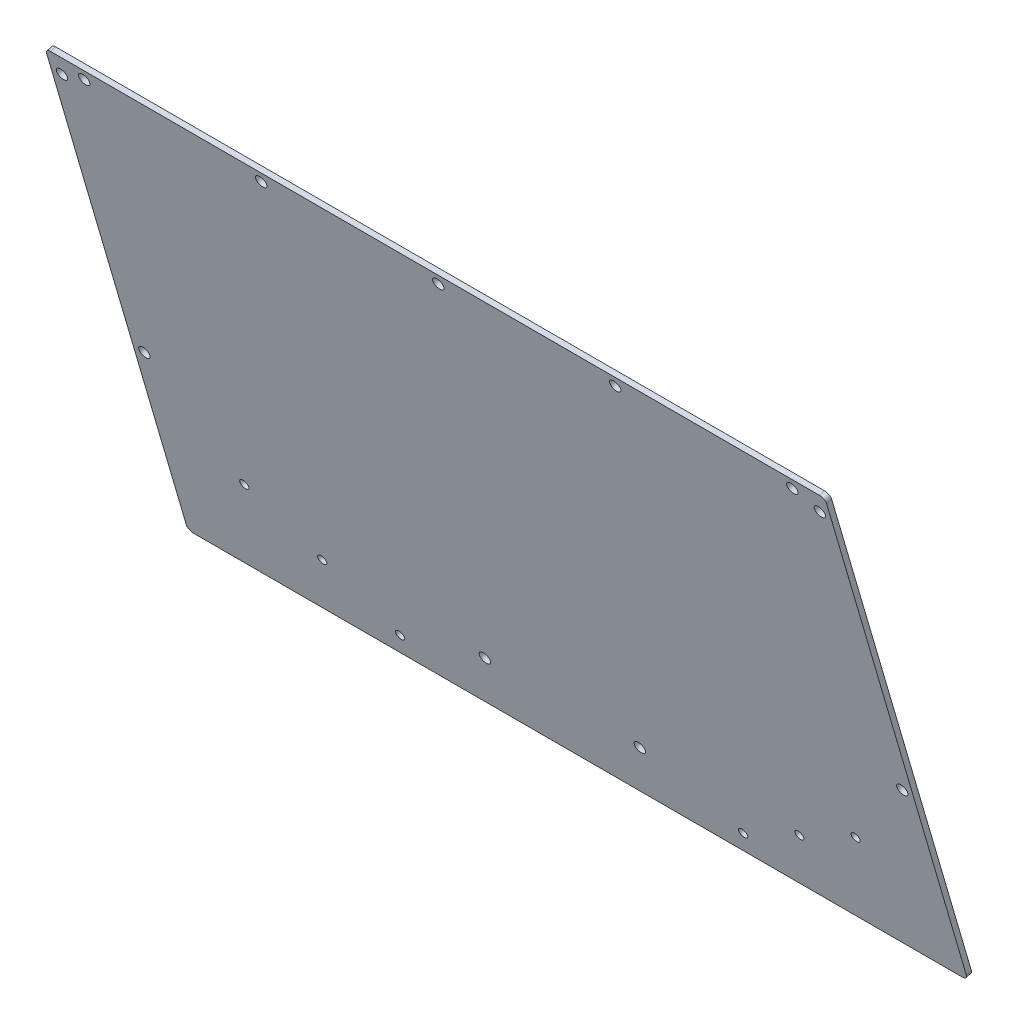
ISO-10303-21;
HEADER;
FILE_DESCRIPTION(('STEP AP214'),'2;1');
FILE_NAME('part.step','',(''),(''),'','','');
FILE_SCHEMA(('AUTOMOTIVE_DESIGN { 1 0 10303 214 1 1 1 1 }'));
ENDSEC;
DATA;
#1=APPLICATION_CONTEXT('core data for automotive mechanical design processes');
#2=APPLICATION_PROTOCOL_DEFINITION('international standard','automotive_design',2000,#1);
#3=PRODUCT_CONTEXT('',#1,'mechanical');
#4=PRODUCT('Part','Part','',(#3));
#5=PRODUCT_RELATED_PRODUCT_CATEGORY('part','',(#4));
#6=PRODUCT_DEFINITION_FORMATION('','',#4);
#7=PRODUCT_DEFINITION_CONTEXT('part definition',#1,'design');
#8=PRODUCT_DEFINITION('design','',#6,#7);
#9=PRODUCT_DEFINITION_SHAPE('','',#8);
#10=(LENGTH_UNIT() NAMED_UNIT(*) SI_UNIT(.MILLI.,.METRE.));
#11=(NAMED_UNIT(*) PLANE_ANGLE_UNIT() SI_UNIT($,.RADIAN.));
#12=(NAMED_UNIT(*) SI_UNIT($,.STERADIAN.) SOLID_ANGLE_UNIT());
#13=UNCERTAINTY_MEASURE_WITH_UNIT(LENGTH_MEASURE(1.E-05),#10,'distance_accuracy_value','');
#14=(GEOMETRIC_REPRESENTATION_CONTEXT(3) GLOBAL_UNCERTAINTY_ASSIGNED_CONTEXT((#13)) GLOBAL_UNIT_ASSIGNED_CONTEXT((#10,
#11,#12)) REPRESENTATION_CONTEXT('',''));
#15=CARTESIAN_POINT('',(0.,0.,0.));
#16=DIRECTION('',(0.,0.,1.));
#17=DIRECTION('',(1.,0.,0.));
#18=AXIS2_PLACEMENT_3D('',#15,#16,#17);
#19=CARTESIAN_POINT('',(203.2,148.986625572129,222.62907670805));
#20=DIRECTION('',(0.,0.280438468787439,-0.959872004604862));
#21=DIRECTION('',(0.,0.959872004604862,0.280438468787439));
#22=AXIS2_PLACEMENT_3D('',#19,#20,#21);
#23=CYLINDRICAL_SURFACE('',#22,3.175);
#24=CARTESIAN_POINT('',(203.2,149.827155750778,219.752148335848));
#25=DIRECTION('',(0.,0.280438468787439,-0.959872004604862));
#26=DIRECTION('',(0.,-0.959872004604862,-0.280438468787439));
#27=AXIS2_PLACEMENT_3D('',#24,#25,#26);
#28=CIRCLE('',#27,3.175);
#29=CARTESIAN_POINT('',(203.2,146.779562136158,218.861756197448));
#30=VERTEX_POINT('',#29);
#31=EDGE_CURVE('E263',#30,#30,#28,.T.);
#32=ORIENTED_EDGE('',*,*,#31,.T.);
#33=EDGE_LOOP('',(#32));
#34=FACE_BOUND('',#33,.T.);
#35=CARTESIAN_POINT('',(203.2,148.986625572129,222.62907670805));
#36=DIRECTION('',(0.,0.280438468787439,-0.959872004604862));
#37=DIRECTION('',(0.,0.959872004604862,0.280438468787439));
#38=AXIS2_PLACEMENT_3D('',#35,#36,#37);
#39=CIRCLE('',#38,3.175);
#40=CARTESIAN_POINT('',(203.2,152.034219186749,223.51946884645));
#41=VERTEX_POINT('',#40);
#42=EDGE_CURVE('E385',#41,#41,#39,.T.);
#43=ORIENTED_EDGE('',*,*,#42,.F.);
#44=EDGE_LOOP('',(#43));
#45=FACE_BOUND('',#44,.T.);
#46=ADVANCED_FACE('F17',(#34,#45),#23,.F.);
#47=CARTESIAN_POINT('',(-101.6,148.986625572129,222.62907670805));
#48=DIRECTION('',(0.,0.280438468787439,-0.959872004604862));
#49=DIRECTION('',(0.,0.959872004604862,0.280438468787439));
#50=AXIS2_PLACEMENT_3D('',#47,#48,#49);
#51=CYLINDRICAL_SURFACE('',#50,3.175);
#52=CARTESIAN_POINT('',(-101.6,149.827155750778,219.752148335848));
#53=DIRECTION('',(0.,0.280438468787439,-0.959872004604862));
#54=DIRECTION('',(0.,-0.959872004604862,-0.280438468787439));
#55=AXIS2_PLACEMENT_3D('',#52,#53,#54);
#56=CIRCLE('',#55,3.175);
#57=CARTESIAN_POINT('',(-101.6,146.779562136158,218.861756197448));
#58=VERTEX_POINT('',#57);
#59=EDGE_CURVE('E266',#58,#58,#56,.T.);
#60=ORIENTED_EDGE('',*,*,#59,.T.);
#61=EDGE_LOOP('',(#60));
#62=FACE_BOUND('',#61,.T.);
#63=CARTESIAN_POINT('',(-101.6,148.986625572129,222.62907670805));
#64=DIRECTION('',(0.,0.280438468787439,-0.959872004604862));
#65=DIRECTION('',(0.,0.959872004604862,0.280438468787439));
#66=AXIS2_PLACEMENT_3D('',#63,#64,#65);
#67=CIRCLE('',#66,3.175);
#68=CARTESIAN_POINT('',(-101.6,152.034219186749,223.51946884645));
#69=VERTEX_POINT('',#68);
#70=EDGE_CURVE('E388',#69,#69,#67,.T.);
#71=ORIENTED_EDGE('',*,*,#70,.F.);
#72=EDGE_LOOP('',(#71));
#73=FACE_BOUND('',#72,.T.);
#74=ADVANCED_FACE('F452',(#62,#73),#51,.F.);
#75=CARTESIAN_POINT('',(-203.2,148.986625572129,222.62907670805));
#76=DIRECTION('',(0.,0.280438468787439,-0.959872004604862));
#77=DIRECTION('',(0.,0.959872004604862,0.280438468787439));
#78=AXIS2_PLACEMENT_3D('',#75,#76,#77);
#79=CYLINDRICAL_SURFACE('',#78,3.175);
#80=CARTESIAN_POINT('',(-203.2,149.827155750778,219.752148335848));
#81=DIRECTION('',(0.,0.280438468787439,-0.959872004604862));
#82=DIRECTION('',(0.,-0.959872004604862,-0.280438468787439));
#83=AXIS2_PLACEMENT_3D('',#80,#81,#82);
#84=CIRCLE('',#83,3.175);
#85=CARTESIAN_POINT('',(-203.2,146.779562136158,218.861756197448));
#86=VERTEX_POINT('',#85);
#87=EDGE_CURVE('E267',#86,#86,#84,.T.);
#88=ORIENTED_EDGE('',*,*,#87,.T.);
#89=EDGE_LOOP('',(#88));
#90=FACE_BOUND('',#89,.T.);
#91=CARTESIAN_POINT('',(-203.2,148.986625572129,222.62907670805));
#92=DIRECTION('',(0.,0.280438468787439,-0.959872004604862));
#93=DIRECTION('',(0.,0.959872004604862,0.280438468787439));
#94=AXIS2_PLACEMENT_3D('',#91,#92,#93);
#95=CIRCLE('',#94,3.175);
#96=CARTESIAN_POINT('',(-203.2,152.034219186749,223.51946884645));
#97=VERTEX_POINT('',#96);
#98=EDGE_CURVE('E391',#97,#97,#95,.T.);
#99=ORIENTED_EDGE('',*,*,#98,.F.);
#100=EDGE_LOOP('',(#99));
#101=FACE_BOUND('',#100,.T.);
#102=ADVANCED_FACE('F458',(#90,#101),#79,.F.);
#103=CARTESIAN_POINT('',(101.6,148.986625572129,222.62907670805));
#104=DIRECTION('',(0.,0.280438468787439,-0.959872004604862));
#105=DIRECTION('',(0.,0.959872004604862,0.280438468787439));
#106=AXIS2_PLACEMENT_3D('',#103,#104,#105);
#107=CYLINDRICAL_SURFACE('',#106,3.175);
#108=CARTESIAN_POINT('',(101.6,149.827155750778,219.752148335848));
#109=DIRECTION('',(0.,0.280438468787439,-0.959872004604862));
#110=DIRECTION('',(0.,-0.959872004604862,-0.280438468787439));
#111=AXIS2_PLACEMENT_3D('',#108,#109,#110);
#112=CIRCLE('',#111,3.175);
#113=CARTESIAN_POINT('',(101.6,146.779562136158,218.861756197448));
#114=VERTEX_POINT('',#113);
#115=EDGE_CURVE('E270',#114,#114,#112,.T.);
#116=ORIENTED_EDGE('',*,*,#115,.T.);
#117=EDGE_LOOP('',(#116));
#118=FACE_BOUND('',#117,.T.);
#119=CARTESIAN_POINT('',(101.6,148.986625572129,222.62907670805));
#120=DIRECTION('',(0.,0.280438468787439,-0.959872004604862));
#121=DIRECTION('',(0.,0.959872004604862,0.280438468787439));
#122=AXIS2_PLACEMENT_3D('',#119,#120,#121);
#123=CIRCLE('',#122,3.175);
#124=CARTESIAN_POINT('',(101.6,152.034219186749,223.51946884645));
#125=VERTEX_POINT('',#124);
#126=EDGE_CURVE('E396',#125,#125,#123,.T.);
#127=ORIENTED_EDGE('',*,*,#126,.F.);
#128=EDGE_LOOP('',(#127));
#129=FACE_BOUND('',#128,.T.);
#130=ADVANCED_FACE('F537',(#118,#129),#107,.F.);
#131=CARTESIAN_POINT('',(0.,148.986625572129,222.62907670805));
#132=DIRECTION('',(0.,0.280438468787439,-0.959872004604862));
#133=DIRECTION('',(0.,0.959872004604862,0.280438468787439));
#134=AXIS2_PLACEMENT_3D('',#131,#132,#133);
#135=CYLINDRICAL_SURFACE('',#134,3.175);
#136=CARTESIAN_POINT('',(0.,149.827155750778,219.752148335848));
#137=DIRECTION('',(0.,0.280438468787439,-0.959872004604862));
#138=DIRECTION('',(0.,-0.959872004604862,-0.280438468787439));
#139=AXIS2_PLACEMENT_3D('',#136,#137,#138);
#140=CIRCLE('',#139,3.175);
#141=CARTESIAN_POINT('',(0.,146.779562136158,218.861756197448));
#142=VERTEX_POINT('',#141);
#143=EDGE_CURVE('E273',#142,#142,#140,.T.);
#144=ORIENTED_EDGE('',*,*,#143,.T.);
#145=EDGE_LOOP('',(#144));
#146=FACE_BOUND('',#145,.T.);
#147=CARTESIAN_POINT('',(0.,148.986625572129,222.62907670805));
#148=DIRECTION('',(0.,0.280438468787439,-0.959872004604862));
#149=DIRECTION('',(0.,0.959872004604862,0.280438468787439));
#150=AXIS2_PLACEMENT_3D('',#147,#148,#149);
#151=CIRCLE('',#150,3.175);
#152=CARTESIAN_POINT('',(0.,152.034219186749,223.51946884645));
#153=VERTEX_POINT('',#152);
#154=EDGE_CURVE('E399',#153,#153,#151,.T.);
#155=ORIENTED_EDGE('',*,*,#154,.F.);
#156=EDGE_LOOP('',(#155));
#157=FACE_BOUND('',#156,.T.);
#158=ADVANCED_FACE('F544',(#146,#157),#135,.F.);
#159=CARTESIAN_POINT('',(-44.45,-94.8208635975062,151.39770563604));
#160=DIRECTION('',(0.,0.280438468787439,-0.959872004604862));
#161=DIRECTION('',(0.,0.959872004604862,0.280438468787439));
#162=AXIS2_PLACEMENT_3D('',#159,#160,#161);
#163=CYLINDRICAL_SURFACE('',#162,3.175);
#164=CARTESIAN_POINT('',(-44.45,-93.9803334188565,148.520777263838));
#165=DIRECTION('',(0.,0.280438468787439,-0.959872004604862));
#166=DIRECTION('',(0.,-0.959872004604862,-0.280438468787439));
#167=AXIS2_PLACEMENT_3D('',#164,#165,#166);
#168=CIRCLE('',#167,3.175);
#169=CARTESIAN_POINT('',(-44.45,-97.0279270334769,147.630385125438));
#170=VERTEX_POINT('',#169);
#171=EDGE_CURVE('E276',#170,#170,#168,.T.);
#172=ORIENTED_EDGE('',*,*,#171,.T.);
#173=EDGE_LOOP('',(#172));
#174=FACE_BOUND('',#173,.T.);
#175=CARTESIAN_POINT('',(-44.45,-94.8208635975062,151.39770563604));
#176=DIRECTION('',(0.,0.280438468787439,-0.959872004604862));
#177=DIRECTION('',(0.,0.959872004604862,0.280438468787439));
#178=AXIS2_PLACEMENT_3D('',#175,#176,#177);
#179=CIRCLE('',#178,3.175);
#180=CARTESIAN_POINT('',(-44.45,-91.7732699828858,152.288097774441));
#181=VERTEX_POINT('',#180);
#182=EDGE_CURVE('E404',#181,#181,#179,.T.);
#183=ORIENTED_EDGE('',*,*,#182,.F.);
#184=EDGE_LOOP('',(#183));
#185=FACE_BOUND('',#184,.T.);
#186=ADVANCED_FACE('F550',(#174,#185),#163,.F.);
#187=CARTESIAN_POINT('',(44.45,-94.8208635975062,151.39770563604));
#188=DIRECTION('',(0.,0.280438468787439,-0.959872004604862));
#189=DIRECTION('',(0.,0.959872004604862,0.280438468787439));
#190=AXIS2_PLACEMENT_3D('',#187,#188,#189);
#191=CYLINDRICAL_SURFACE('',#190,3.175);
#192=CARTESIAN_POINT('',(44.45,-93.9803334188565,148.520777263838));
#193=DIRECTION('',(0.,0.280438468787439,-0.959872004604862));
#194=DIRECTION('',(0.,-0.959872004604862,-0.280438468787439));
#195=AXIS2_PLACEMENT_3D('',#192,#193,#194);
#196=CIRCLE('',#195,3.175);
#197=CARTESIAN_POINT('',(44.45,-97.0279270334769,147.630385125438));
#198=VERTEX_POINT('',#197);
#199=EDGE_CURVE('E277',#198,#198,#196,.T.);
#200=ORIENTED_EDGE('',*,*,#199,.T.);
#201=EDGE_LOOP('',(#200));
#202=FACE_BOUND('',#201,.T.);
#203=CARTESIAN_POINT('',(44.45,-94.8208635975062,151.39770563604));
#204=DIRECTION('',(0.,0.280438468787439,-0.959872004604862));
#205=DIRECTION('',(0.,0.959872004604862,0.280438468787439));
#206=AXIS2_PLACEMENT_3D('',#203,#204,#205);
#207=CIRCLE('',#206,3.175);
#208=CARTESIAN_POINT('',(44.45,-91.7732699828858,152.288097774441));
#209=VERTEX_POINT('',#208);
#210=EDGE_CURVE('E406',#209,#209,#207,.T.);
#211=ORIENTED_EDGE('',*,*,#210,.F.);
#212=EDGE_LOOP('',(#211));
#213=FACE_BOUND('',#212,.T.);
#214=ADVANCED_FACE('F553',(#202,#213),#191,.F.);
#215=CARTESIAN_POINT('',(-175.414658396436,-70.4401146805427,158.520842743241));
#216=DIRECTION('',(0.,0.280438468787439,-0.959872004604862));
#217=DIRECTION('',(0.,0.959872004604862,0.280438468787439));
#218=AXIS2_PLACEMENT_3D('',#215,#216,#217);
#219=CYLINDRICAL_SURFACE('',#218,2.5527);
#220=CARTESIAN_POINT('',(-175.414658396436,-69.599584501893,155.643914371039));
#221=DIRECTION('',(0.,0.280438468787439,-0.959872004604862));
#222=DIRECTION('',(0.,-0.959872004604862,-0.280438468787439));
#223=AXIS2_PLACEMENT_3D('',#220,#221,#222);
#224=CIRCLE('',#223,2.5527);
#225=CARTESIAN_POINT('',(-175.414658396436,-72.0498497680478,154.928039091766));
#226=VERTEX_POINT('',#225);
#227=EDGE_CURVE('E280',#226,#226,#224,.T.);
#228=ORIENTED_EDGE('',*,*,#227,.T.);
#229=EDGE_LOOP('',(#228));
#230=FACE_BOUND('',#229,.T.);
#231=CARTESIAN_POINT('',(-175.414658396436,-70.4401146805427,158.520842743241));
#232=DIRECTION('',(0.,0.280438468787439,-0.959872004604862));
#233=DIRECTION('',(0.,0.959872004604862,0.280438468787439));
#234=AXIS2_PLACEMENT_3D('',#231,#232,#233);
#235=CIRCLE('',#234,2.5527);
#236=CARTESIAN_POINT('',(-175.414658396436,-67.9898494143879,159.236718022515));
#237=VERTEX_POINT('',#236);
#238=EDGE_CURVE('E410',#237,#237,#235,.T.);
#239=ORIENTED_EDGE('',*,*,#238,.F.);
#240=EDGE_LOOP('',(#239));
#241=FACE_BOUND('',#240,.T.);
#242=ADVANCED_FACE('F558',(#230,#241),#219,.F.);
#243=CARTESIAN_POINT('',(-136.919829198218,-91.7732699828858,152.288097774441));
#244=DIRECTION('',(0.,0.280438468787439,-0.959872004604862));
#245=DIRECTION('',(0.,0.959872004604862,0.280438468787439));
#246=AXIS2_PLACEMENT_3D('',#243,#244,#245);
#247=CYLINDRICAL_SURFACE('',#246,2.5527);
#248=CARTESIAN_POINT('',(-136.919829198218,-90.9327398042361,149.411169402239));
#249=DIRECTION('',(0.,0.280438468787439,-0.959872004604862));
#250=DIRECTION('',(0.,-0.959872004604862,-0.280438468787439));
#251=AXIS2_PLACEMENT_3D('',#248,#249,#250);
#252=CIRCLE('',#251,2.5527);
#253=CARTESIAN_POINT('',(-136.919829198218,-93.3830050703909,148.695294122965));
#254=VERTEX_POINT('',#253);
#255=EDGE_CURVE('E281',#254,#254,#252,.T.);
#256=ORIENTED_EDGE('',*,*,#255,.T.);
#257=EDGE_LOOP('',(#256));
#258=FACE_BOUND('',#257,.T.);
#259=CARTESIAN_POINT('',(-136.919829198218,-91.7732699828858,152.288097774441));
#260=DIRECTION('',(0.,0.280438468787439,-0.959872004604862));
#261=DIRECTION('',(0.,0.959872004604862,0.280438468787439));
#262=AXIS2_PLACEMENT_3D('',#259,#260,#261);
#263=CIRCLE('',#262,2.5527);
#264=CARTESIAN_POINT('',(-136.919829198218,-89.323004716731,153.003973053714));
#265=VERTEX_POINT('',#264);
#266=EDGE_CURVE('E413',#265,#265,#263,.T.);
#267=ORIENTED_EDGE('',*,*,#266,.F.);
#268=EDGE_LOOP('',(#267));
#269=FACE_BOUND('',#268,.T.);
#270=ADVANCED_FACE('F562',(#258,#269),#247,.F.);
#271=CARTESIAN_POINT('',(-98.425,-113.106425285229,146.055352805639));
#272=DIRECTION('',(0.,0.280438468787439,-0.959872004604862));
#273=DIRECTION('',(0.,0.959872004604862,0.280438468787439));
#274=AXIS2_PLACEMENT_3D('',#271,#272,#273);
#275=CYLINDRICAL_SURFACE('',#274,2.5527);
#276=CARTESIAN_POINT('',(-98.425,-112.265895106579,143.178424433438));
#277=DIRECTION('',(0.,0.280438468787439,-0.959872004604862));
#278=DIRECTION('',(0.,-0.959872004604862,-0.280438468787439));
#279=AXIS2_PLACEMENT_3D('',#276,#277,#278);
#280=CIRCLE('',#279,2.5527);
#281=CARTESIAN_POINT('',(-98.425,-114.716160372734,142.462549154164));
#282=VERTEX_POINT('',#281);
#283=EDGE_CURVE('E284',#282,#282,#280,.T.);
#284=ORIENTED_EDGE('',*,*,#283,.T.);
#285=EDGE_LOOP('',(#284));
#286=FACE_BOUND('',#285,.T.);
#287=CARTESIAN_POINT('',(-98.425,-113.106425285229,146.055352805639));
#288=DIRECTION('',(0.,0.280438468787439,-0.959872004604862));
#289=DIRECTION('',(0.,0.959872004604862,0.280438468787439));
#290=AXIS2_PLACEMENT_3D('',#287,#288,#289);
#291=CIRCLE('',#290,2.5527);
#292=CARTESIAN_POINT('',(-98.425,-110.656160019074,146.771228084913));
#293=VERTEX_POINT('',#292);
#294=EDGE_CURVE('E416',#293,#293,#291,.T.);
#295=ORIENTED_EDGE('',*,*,#294,.F.);
#296=EDGE_LOOP('',(#295));
#297=FACE_BOUND('',#296,.T.);
#298=ADVANCED_FACE('F497',(#286,#297),#275,.F.);
#299=CARTESIAN_POINT('',(175.414658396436,-70.4401146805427,158.520842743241));
#300=DIRECTION('',(0.,0.280438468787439,-0.959872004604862));
#301=DIRECTION('',(0.,0.959872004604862,0.280438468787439));
#302=AXIS2_PLACEMENT_3D('',#299,#300,#301);
#303=CYLINDRICAL_SURFACE('',#302,2.5527);
#304=CARTESIAN_POINT('',(175.414658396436,-69.599584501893,155.643914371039));
#305=DIRECTION('',(0.,0.280438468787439,-0.959872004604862));
#306=DIRECTION('',(0.,-0.959872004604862,-0.280438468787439));
#307=AXIS2_PLACEMENT_3D('',#304,#305,#306);
#308=CIRCLE('',#307,2.5527);
#309=CARTESIAN_POINT('',(175.414658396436,-72.0498497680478,154.928039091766));
#310=VERTEX_POINT('',#309);
#311=EDGE_CURVE('E289',#310,#310,#308,.T.);
#312=ORIENTED_EDGE('',*,*,#311,.T.);
#313=EDGE_LOOP('',(#312));
#314=FACE_BOUND('',#313,.T.);
#315=CARTESIAN_POINT('',(175.414658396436,-70.4401146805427,158.520842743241));
#316=DIRECTION('',(0.,0.280438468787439,-0.959872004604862));
#317=DIRECTION('',(0.,0.959872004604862,0.280438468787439));
#318=AXIS2_PLACEMENT_3D('',#315,#316,#317);
#319=CIRCLE('',#318,2.5527);
#320=CARTESIAN_POINT('',(175.414658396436,-67.9898494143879,159.236718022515));
#321=VERTEX_POINT('',#320);
#322=EDGE_CURVE('E419',#321,#321,#319,.T.);
#323=ORIENTED_EDGE('',*,*,#322,.F.);
#324=EDGE_LOOP('',(#323));
#325=FACE_BOUND('',#324,.T.);
#326=ADVANCED_FACE('F494',(#314,#325),#303,.F.);
#327=CARTESIAN_POINT('',(136.919829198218,-91.7732699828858,152.288097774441));
#328=DIRECTION('',(0.,0.280438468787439,-0.959872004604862));
#329=DIRECTION('',(0.,0.959872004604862,0.280438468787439));
#330=AXIS2_PLACEMENT_3D('',#327,#328,#329);
#331=CYLINDRICAL_SURFACE('',#330,2.5527);
#332=CARTESIAN_POINT('',(136.919829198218,-90.9327398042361,149.411169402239));
#333=DIRECTION('',(0.,0.280438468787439,-0.959872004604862));
#334=DIRECTION('',(0.,-0.959872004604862,-0.280438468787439));
#335=AXIS2_PLACEMENT_3D('',#332,#333,#334);
#336=CIRCLE('',#335,2.5527);
#337=CARTESIAN_POINT('',(136.919829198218,-93.3830050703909,148.695294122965));
#338=VERTEX_POINT('',#337);
#339=EDGE_CURVE('E285',#338,#338,#336,.T.);
#340=ORIENTED_EDGE('',*,*,#339,.T.);
#341=EDGE_LOOP('',(#340));
#342=FACE_BOUND('',#341,.T.);
#343=CARTESIAN_POINT('',(136.919829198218,-91.7732699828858,152.288097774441));
#344=DIRECTION('',(0.,0.280438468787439,-0.959872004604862));
#345=DIRECTION('',(0.,0.959872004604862,0.280438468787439));
#346=AXIS2_PLACEMENT_3D('',#343,#344,#345);
#347=CIRCLE('',#346,2.5527);
#348=CARTESIAN_POINT('',(136.919829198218,-89.323004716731,153.003973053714));
#349=VERTEX_POINT('',#348);
#350=EDGE_CURVE('E423',#349,#349,#347,.T.);
#351=ORIENTED_EDGE('',*,*,#350,.F.);
#352=EDGE_LOOP('',(#351));
#353=FACE_BOUND('',#352,.T.);
#354=ADVANCED_FACE('F496',(#342,#353),#331,.F.);
#355=CARTESIAN_POINT('',(98.425,-113.106425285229,146.055352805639));
#356=DIRECTION('',(0.,0.280438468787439,-0.959872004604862));
#357=DIRECTION('',(0.,0.959872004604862,0.280438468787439));
#358=AXIS2_PLACEMENT_3D('',#355,#356,#357);
#359=CYLINDRICAL_SURFACE('',#358,2.5527);
#360=CARTESIAN_POINT('',(98.425,-112.265895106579,143.178424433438));
#361=DIRECTION('',(0.,0.280438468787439,-0.959872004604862));
#362=DIRECTION('',(0.,-0.959872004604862,-0.280438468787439));
#363=AXIS2_PLACEMENT_3D('',#360,#361,#362);
#364=CIRCLE('',#363,2.5527);
#365=CARTESIAN_POINT('',(98.425,-114.716160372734,142.462549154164));
#366=VERTEX_POINT('',#365);
#367=EDGE_CURVE('E288',#366,#366,#364,.T.);
#368=ORIENTED_EDGE('',*,*,#367,.T.);
#369=EDGE_LOOP('',(#368));
#370=FACE_BOUND('',#369,.T.);
#371=CARTESIAN_POINT('',(98.425,-113.106425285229,146.05535280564));
#372=DIRECTION('',(0.,0.280438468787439,-0.959872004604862));
#373=DIRECTION('',(0.,0.959872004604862,0.280438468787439));
#374=AXIS2_PLACEMENT_3D('',#371,#372,#373);
#375=CIRCLE('',#374,2.5527);
#376=CARTESIAN_POINT('',(98.425,-110.656160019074,146.771228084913));
#377=VERTEX_POINT('',#376);
#378=EDGE_CURVE('E420',#377,#377,#375,.T.);
#379=ORIENTED_EDGE('',*,*,#378,.F.);
#380=EDGE_LOOP('',(#379));
#381=FACE_BOUND('',#380,.T.);
#382=ADVANCED_FACE('F501',(#370,#381),#359,.F.);
#383=CARTESIAN_POINT('',(220.6625,152.03421918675,223.51946884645));
#384=DIRECTION('',(0.,-0.280438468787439,0.959872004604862));
#385=DIRECTION('',(0.,-0.959872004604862,-0.280438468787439));
#386=AXIS2_PLACEMENT_3D('',#383,#384,#385);
#387=CYLINDRICAL_SURFACE('',#386,3.175);
#388=CARTESIAN_POINT('',(220.6625,152.03421918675,223.51946884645));
#389=DIRECTION('',(0.,-0.280438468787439,0.959872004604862));
#390=DIRECTION('',(0.,-0.959872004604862,-0.280438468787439));
#391=AXIS2_PLACEMENT_3D('',#388,#389,#390);
#392=CIRCLE('',#391,3.175);
#393=CARTESIAN_POINT('',(223.8375,152.03421918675,223.51946884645));
#394=VERTEX_POINT('',#393);
#395=CARTESIAN_POINT('',(220.6625,155.081812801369,224.40986098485));
#396=VERTEX_POINT('',#395);
#397=EDGE_CURVE('E257',#394,#396,#392,.T.);
#398=ORIENTED_EDGE('',*,*,#397,.F.);
#399=DIRECTION('',(0.,-0.280438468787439,0.959872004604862));
#400=VECTOR('',#399,1.);
#401=CARTESIAN_POINT('',(223.8375,152.03421918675,223.51946884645));
#402=LINE('',#401,#400);
#403=CARTESIAN_POINT('',(223.8375,152.874749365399,220.642540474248));
#404=VERTEX_POINT('',#403);
#405=EDGE_CURVE('E326',#404,#394,#402,.T.);
#406=ORIENTED_EDGE('',*,*,#405,.F.);
#407=CARTESIAN_POINT('',(220.6625,152.874749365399,220.642540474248));
#408=DIRECTION('',(0.,0.280438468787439,-0.959872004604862));
#409=DIRECTION('',(0.,-0.959872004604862,-0.280438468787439));
#410=AXIS2_PLACEMENT_3D('',#407,#408,#409);
#411=CIRCLE('',#410,3.175);
#412=CARTESIAN_POINT('',(220.6625,155.92234298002,221.532932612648));
#413=VERTEX_POINT('',#412);
#414=EDGE_CURVE('E20',#413,#404,#411,.T.);
#415=ORIENTED_EDGE('',*,*,#414,.F.);
#416=DIRECTION('',(0.,0.280438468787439,-0.959872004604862));
#417=VECTOR('',#416,1.);
#418=CARTESIAN_POINT('',(220.6625,155.92234298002,221.532932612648));
#419=LINE('',#418,#417);
#420=EDGE_CURVE('E363',#396,#413,#419,.T.);
#421=ORIENTED_EDGE('',*,*,#420,.F.);
#422=EDGE_LOOP('',(#398,#406,#415,#421));
#423=FACE_BOUND('',#422,.T.);
#424=ADVANCED_FACE('F507',(#423),#387,.T.);
#425=CARTESIAN_POINT('',(-220.6625,152.03421918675,223.51946884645));
#426=DIRECTION('',(0.,0.280438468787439,-0.959872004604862));
#427=DIRECTION('',(0.,0.959872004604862,0.280438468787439));
#428=AXIS2_PLACEMENT_3D('',#425,#426,#427);
#429=CYLINDRICAL_SURFACE('',#428,3.175);
#430=CARTESIAN_POINT('',(-220.6625,152.034219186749,223.51946884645));
#431=DIRECTION('',(0.,-0.280438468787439,0.959872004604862));
#432=DIRECTION('',(0.,-0.959872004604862,-0.280438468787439));
#433=AXIS2_PLACEMENT_3D('',#430,#431,#432);
#434=CIRCLE('',#433,3.175);
#435=CARTESIAN_POINT('',(-220.6625,155.081812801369,224.40986098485));
#436=VERTEX_POINT('',#435);
#437=CARTESIAN_POINT('',(-223.8375,152.03421918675,223.51946884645));
#438=VERTEX_POINT('',#437);
#439=EDGE_CURVE('E260',#436,#438,#434,.T.);
#440=ORIENTED_EDGE('',*,*,#439,.F.);
#441=DIRECTION('',(0.,-0.280438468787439,0.959872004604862));
#442=VECTOR('',#441,1.);
#443=CARTESIAN_POINT('',(-220.6625,155.081812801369,224.40986098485));
#444=LINE('',#443,#442);
#445=CARTESIAN_POINT('',(-220.6625,155.92234298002,221.532932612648));
#446=VERTEX_POINT('',#445);
#447=EDGE_CURVE('E325',#446,#436,#444,.T.);
#448=ORIENTED_EDGE('',*,*,#447,.F.);
#449=CARTESIAN_POINT('',(-220.6625,152.874749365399,220.642540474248));
#450=DIRECTION('',(0.,0.280438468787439,-0.959872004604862));
#451=DIRECTION('',(0.,-0.959872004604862,-0.280438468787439));
#452=AXIS2_PLACEMENT_3D('',#449,#450,#451);
#453=CIRCLE('',#452,3.175);
#454=CARTESIAN_POINT('',(-223.8375,152.874749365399,220.642540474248));
#455=VERTEX_POINT('',#454);
#456=EDGE_CURVE('E299',#455,#446,#453,.T.);
#457=ORIENTED_EDGE('',*,*,#456,.F.);
#458=DIRECTION('',(0.,0.280438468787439,-0.959872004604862));
#459=VECTOR('',#458,1.);
#460=CARTESIAN_POINT('',(-223.8375,152.03421918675,223.51946884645));
#461=LINE('',#460,#459);
#462=EDGE_CURVE('E360',#438,#455,#461,.T.);
#463=ORIENTED_EDGE('',*,*,#462,.F.);
#464=EDGE_LOOP('',(#440,#448,#457,#463));
#465=FACE_BOUND('',#464,.T.);
#466=ADVANCED_FACE('F572',(#465),#429,.T.);
#467=CARTESIAN_POINT('',(220.6625,-122.24920612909,143.384176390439));
#468=DIRECTION('',(0.,0.280438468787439,-0.959872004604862));
#469=DIRECTION('',(0.,0.959872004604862,0.280438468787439));
#470=AXIS2_PLACEMENT_3D('',#467,#468,#469);
#471=CYLINDRICAL_SURFACE('',#470,3.175);
#472=CARTESIAN_POINT('',(220.6625,-122.24920612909,143.384176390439));
#473=DIRECTION('',(0.,-0.280438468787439,0.959872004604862));
#474=DIRECTION('',(0.,-0.959872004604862,-0.280438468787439));
#475=AXIS2_PLACEMENT_3D('',#472,#473,#474);
#476=CIRCLE('',#475,3.175);
#477=CARTESIAN_POINT('',(220.6625,-125.296799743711,142.493784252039));
#478=VERTEX_POINT('',#477);
#479=CARTESIAN_POINT('',(223.8375,-122.24920612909,143.384176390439));
#480=VERTEX_POINT('',#479);
#481=EDGE_CURVE('E256',#478,#480,#476,.T.);
#482=ORIENTED_EDGE('',*,*,#481,.F.);
#483=DIRECTION('',(0.,-0.280438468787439,0.959872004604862));
#484=VECTOR('',#483,1.);
#485=CARTESIAN_POINT('',(220.6625,-125.296799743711,142.493784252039));
#486=LINE('',#485,#484);
#487=CARTESIAN_POINT('',(220.6625,-124.456269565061,139.616855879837));
#488=VERTEX_POINT('',#487);
#489=EDGE_CURVE('E334',#488,#478,#486,.T.);
#490=ORIENTED_EDGE('',*,*,#489,.F.);
#491=CARTESIAN_POINT('',(220.6625,-121.40867595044,140.507248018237));
#492=DIRECTION('',(0.,0.280438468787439,-0.959872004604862));
#493=DIRECTION('',(0.,-0.959872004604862,-0.280438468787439));
#494=AXIS2_PLACEMENT_3D('',#491,#492,#493);
#495=CIRCLE('',#494,3.175);
#496=CARTESIAN_POINT('',(223.8375,-121.40867595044,140.507248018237));
#497=VERTEX_POINT('',#496);
#498=EDGE_CURVE('E11',#497,#488,#495,.T.);
#499=ORIENTED_EDGE('',*,*,#498,.F.);
#500=DIRECTION('',(0.,0.280438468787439,-0.959872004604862));
#501=VECTOR('',#500,1.);
#502=CARTESIAN_POINT('',(223.8375,-122.24920612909,143.384176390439));
#503=LINE('',#502,#501);
#504=EDGE_CURVE('E350',#480,#497,#503,.T.);
#505=ORIENTED_EDGE('',*,*,#504,.F.);
#506=EDGE_LOOP('',(#482,#490,#499,#505));
#507=FACE_BOUND('',#506,.T.);
#508=ADVANCED_FACE('F448',(#507),#471,.T.);
#509=CARTESIAN_POINT('',(-220.6625,-122.24920612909,143.384176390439));
#510=DIRECTION('',(0.,-0.280438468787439,0.959872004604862));
#511=DIRECTION('',(0.,-0.959872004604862,-0.280438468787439));
#512=AXIS2_PLACEMENT_3D('',#509,#510,#511);
#513=CYLINDRICAL_SURFACE('',#512,3.175);
#514=CARTESIAN_POINT('',(-220.6625,-122.24920612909,143.384176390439));
#515=DIRECTION('',(0.,-0.280438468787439,0.959872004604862));
#516=DIRECTION('',(0.,-0.959872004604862,-0.280438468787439));
#517=AXIS2_PLACEMENT_3D('',#514,#515,#516);
#518=CIRCLE('',#517,3.175);
#519=CARTESIAN_POINT('',(-223.8375,-122.24920612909,143.384176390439));
#520=VERTEX_POINT('',#519);
#521=CARTESIAN_POINT('',(-220.6625,-125.296799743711,142.493784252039));
#522=VERTEX_POINT('',#521);
#523=EDGE_CURVE('E248',#520,#522,#518,.T.);
#524=ORIENTED_EDGE('',*,*,#523,.F.);
#525=DIRECTION('',(0.,-0.280438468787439,0.959872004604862));
#526=VECTOR('',#525,1.);
#527=CARTESIAN_POINT('',(-223.8375,-122.24920612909,143.384176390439));
#528=LINE('',#527,#526);
#529=CARTESIAN_POINT('',(-223.8375,-121.40867595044,140.507248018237));
#530=VERTEX_POINT('',#529);
#531=EDGE_CURVE('E335',#530,#520,#528,.T.);
#532=ORIENTED_EDGE('',*,*,#531,.F.);
#533=CARTESIAN_POINT('',(-220.6625,-121.40867595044,140.507248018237));
#534=DIRECTION('',(0.,0.280438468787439,-0.959872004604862));
#535=DIRECTION('',(0.,-0.959872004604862,-0.280438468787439));
#536=AXIS2_PLACEMENT_3D('',#533,#534,#535);
#537=CIRCLE('',#536,3.175);
#538=CARTESIAN_POINT('',(-220.6625,-124.456269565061,139.616855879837));
#539=VERTEX_POINT('',#538);
#540=EDGE_CURVE('E297',#539,#530,#537,.T.);
#541=ORIENTED_EDGE('',*,*,#540,.F.);
#542=DIRECTION('',(0.,0.280438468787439,-0.959872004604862));
#543=VECTOR('',#542,1.);
#544=CARTESIAN_POINT('',(-220.6625,-124.456269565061,139.616855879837));
#545=LINE('',#544,#543);
#546=EDGE_CURVE('E320',#522,#539,#545,.T.);
#547=ORIENTED_EDGE('',*,*,#546,.F.);
#548=EDGE_LOOP('',(#524,#532,#541,#547));
#549=FACE_BOUND('',#548,.T.);
#550=ADVANCED_FACE('F436',(#549),#513,.T.);
#551=CARTESIAN_POINT('',(-217.4875,143.696822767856,221.083595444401));
#552=DIRECTION('',(0.,0.280438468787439,-0.959872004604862));
#553=DIRECTION('',(0.,0.959872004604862,0.280438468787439));
#554=AXIS2_PLACEMENT_3D('',#551,#552,#553);
#555=CYLINDRICAL_SURFACE('',#554,3.175);
#556=CARTESIAN_POINT('',(-217.4875,144.537352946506,218.206667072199));
#557=DIRECTION('',(0.,0.280438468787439,-0.959872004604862));
#558=DIRECTION('',(0.,-0.959872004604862,-0.280438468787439));
#559=AXIS2_PLACEMENT_3D('',#556,#557,#558);
#560=CIRCLE('',#559,3.175);
#561=CARTESIAN_POINT('',(-217.4875,141.489759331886,217.316274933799));
#562=VERTEX_POINT('',#561);
#563=EDGE_CURVE('E292',#562,#562,#560,.T.);
#564=ORIENTED_EDGE('',*,*,#563,.T.);
#565=EDGE_LOOP('',(#564));
#566=FACE_BOUND('',#565,.T.);
#567=CARTESIAN_POINT('',(-217.4875,143.696822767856,221.083595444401));
#568=DIRECTION('',(0.,0.280438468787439,-0.959872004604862));
#569=DIRECTION('',(0.,0.959872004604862,0.280438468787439));
#570=AXIS2_PLACEMENT_3D('',#567,#568,#569);
#571=CIRCLE('',#570,3.175);
#572=CARTESIAN_POINT('',(-217.4875,146.744416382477,221.973987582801));
#573=VERTEX_POINT('',#572);
#574=EDGE_CURVE('E250',#573,#573,#571,.T.);
#575=ORIENTED_EDGE('',*,*,#574,.F.);
#576=EDGE_LOOP('',(#575));
#577=FACE_BOUND('',#576,.T.);
#578=ADVANCED_FACE('F433',(#566,#577),#555,.F.);
#579=CARTESIAN_POINT('',(-217.4875,-18.228177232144,173.775205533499));
#580=DIRECTION('',(0.,0.280438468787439,-0.959872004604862));
#581=DIRECTION('',(0.,0.959872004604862,0.280438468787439));
#582=AXIS2_PLACEMENT_3D('',#579,#580,#581);
#583=CYLINDRICAL_SURFACE('',#582,3.175);
#584=CARTESIAN_POINT('',(-217.4875,-17.3876470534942,170.898277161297));
#585=DIRECTION('',(0.,0.280438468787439,-0.959872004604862));
#586=DIRECTION('',(0.,-0.959872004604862,-0.280438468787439));
#587=AXIS2_PLACEMENT_3D('',#584,#585,#586);
#588=CIRCLE('',#587,3.175);
#589=CARTESIAN_POINT('',(-217.4875,-20.4352406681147,170.007885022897));
#590=VERTEX_POINT('',#589);
#591=EDGE_CURVE('E295',#590,#590,#588,.T.);
#592=ORIENTED_EDGE('',*,*,#591,.T.);
#593=EDGE_LOOP('',(#592));
#594=FACE_BOUND('',#593,.T.);
#595=CARTESIAN_POINT('',(-217.4875,-18.228177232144,173.775205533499));
#596=DIRECTION('',(0.,0.280438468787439,-0.959872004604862));
#597=DIRECTION('',(0.,0.959872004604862,0.280438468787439));
#598=AXIS2_PLACEMENT_3D('',#595,#596,#597);
#599=CIRCLE('',#598,3.175);
#600=CARTESIAN_POINT('',(-217.4875,-15.1805836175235,174.665597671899));
#601=VERTEX_POINT('',#600);
#602=EDGE_CURVE('E243',#601,#601,#599,.T.);
#603=ORIENTED_EDGE('',*,*,#602,.F.);
#604=EDGE_LOOP('',(#603));
#605=FACE_BOUND('',#604,.T.);
#606=ADVANCED_FACE('F435',(#594,#605),#583,.F.);
#607=CARTESIAN_POINT('',(217.4875,-18.228177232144,173.775205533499));
#608=DIRECTION('',(0.,0.280438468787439,-0.959872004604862));
#609=DIRECTION('',(0.,0.959872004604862,0.280438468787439));
#610=AXIS2_PLACEMENT_3D('',#607,#608,#609);
#611=CYLINDRICAL_SURFACE('',#610,3.175);
#612=CARTESIAN_POINT('',(217.4875,-17.3876470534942,170.898277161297));
#613=DIRECTION('',(0.,0.280438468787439,-0.959872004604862));
#614=DIRECTION('',(0.,-0.959872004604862,-0.280438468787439));
#615=AXIS2_PLACEMENT_3D('',#612,#613,#614);
#616=CIRCLE('',#615,3.175);
#617=CARTESIAN_POINT('',(217.4875,-20.4352406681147,170.007885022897));
#618=VERTEX_POINT('',#617);
#619=EDGE_CURVE('E43',#618,#618,#616,.T.);
#620=ORIENTED_EDGE('',*,*,#619,.T.);
#621=EDGE_LOOP('',(#620));
#622=FACE_BOUND('',#621,.T.);
#623=CARTESIAN_POINT('',(217.4875,-18.228177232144,173.775205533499));
#624=DIRECTION('',(0.,0.280438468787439,-0.959872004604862));
#625=DIRECTION('',(0.,0.959872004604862,0.280438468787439));
#626=AXIS2_PLACEMENT_3D('',#623,#624,#625);
#627=CIRCLE('',#626,3.175);
#628=CARTESIAN_POINT('',(217.4875,-15.1805836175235,174.665597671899));
#629=VERTEX_POINT('',#628);
#630=EDGE_CURVE('E237',#629,#629,#627,.T.);
#631=ORIENTED_EDGE('',*,*,#630,.F.);
#632=EDGE_LOOP('',(#631));
#633=FACE_BOUND('',#632,.T.);
#634=ADVANCED_FACE('F445',(#622,#633),#611,.F.);
#635=CARTESIAN_POINT('',(217.4875,143.696822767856,221.083595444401));
#636=DIRECTION('',(0.,0.280438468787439,-0.959872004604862));
#637=DIRECTION('',(0.,0.959872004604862,0.280438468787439));
#638=AXIS2_PLACEMENT_3D('',#635,#636,#637);
#639=CYLINDRICAL_SURFACE('',#638,3.175);
#640=CARTESIAN_POINT('',(217.4875,144.537352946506,218.206667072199));
#641=DIRECTION('',(0.,0.280438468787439,-0.959872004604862));
#642=DIRECTION('',(0.,-0.959872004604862,-0.280438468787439));
#643=AXIS2_PLACEMENT_3D('',#640,#641,#642);
#644=CIRCLE('',#643,3.175);
#645=CARTESIAN_POINT('',(217.4875,141.489759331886,217.316274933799));
#646=VERTEX_POINT('',#645);
#647=EDGE_CURVE('E36',#646,#646,#644,.T.);
#648=ORIENTED_EDGE('',*,*,#647,.T.);
#649=EDGE_LOOP('',(#648));
#650=FACE_BOUND('',#649,.T.);
#651=CARTESIAN_POINT('',(217.4875,143.696822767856,221.083595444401));
#652=DIRECTION('',(0.,0.280438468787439,-0.959872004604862));
#653=DIRECTION('',(0.,0.959872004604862,0.280438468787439));
#654=AXIS2_PLACEMENT_3D('',#651,#652,#653);
#655=CIRCLE('',#654,3.175);
#656=CARTESIAN_POINT('',(217.4875,146.744416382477,221.973987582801));
#657=VERTEX_POINT('',#656);
#658=EDGE_CURVE('E242',#657,#657,#655,.T.);
#659=ORIENTED_EDGE('',*,*,#658,.F.);
#660=EDGE_LOOP('',(#659));
#661=FACE_BOUND('',#660,.T.);
#662=ADVANCED_FACE('F477',(#650,#661),#639,.F.);
#663=CARTESIAN_POINT('',(-1.11022302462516E-13,15.7330367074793,180.574894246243));
#664=DIRECTION('',(0.,-0.280438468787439,0.959872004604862));
#665=DIRECTION('',(-1.,0.,0.));
#666=AXIS2_PLACEMENT_3D('',#663,#664,#665);
#667=PLANE('',#666);
#668=DIRECTION('',(1.,0.,0.));
#669=VECTOR('',#668,1.);
#670=CARTESIAN_POINT('',(-223.8375,-124.456269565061,139.616855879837));
#671=LINE('',#670,#669);
#672=EDGE_CURVE('E329',#539,#488,#671,.T.);
#673=ORIENTED_EDGE('',*,*,#672,.F.);
#674=ORIENTED_EDGE('',*,*,#540,.T.);
#675=DIRECTION('',(0.,0.959872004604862,0.280438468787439));
#676=VECTOR('',#675,1.);
#677=CARTESIAN_POINT('',(-223.8375,117.939467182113,210.435766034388));
#678=LINE('',#677,#676);
#679=EDGE_CURVE('E340',#530,#455,#678,.T.);
#680=ORIENTED_EDGE('',*,*,#679,.T.);
#681=ORIENTED_EDGE('',*,*,#456,.T.);
#682=DIRECTION('',(1.,0.,0.));
#683=VECTOR('',#682,1.);
#684=CARTESIAN_POINT('',(-1.11022302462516E-13,155.92234298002,221.532932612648));
#685=LINE('',#684,#683);
#686=EDGE_CURVE('E321',#446,#413,#685,.T.);
#687=ORIENTED_EDGE('',*,*,#686,.T.);
#688=ORIENTED_EDGE('',*,*,#414,.T.);
#689=DIRECTION('',(0.,0.959872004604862,0.280438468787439));
#690=VECTOR('',#689,1.);
#691=CARTESIAN_POINT('',(223.8375,117.939467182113,210.435766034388));
#692=LINE('',#691,#690);
#693=EDGE_CURVE('E356',#497,#404,#692,.T.);
#694=ORIENTED_EDGE('',*,*,#693,.F.);
#695=ORIENTED_EDGE('',*,*,#498,.T.);
#696=EDGE_LOOP('',(#673,#674,#680,#681,#687,#688,#694,#695));
#697=FACE_BOUND('',#696,.T.);
#698=ORIENTED_EDGE('',*,*,#647,.F.);
#699=EDGE_LOOP('',(#698));
#700=FACE_BOUND('',#699,.T.);
#701=ORIENTED_EDGE('',*,*,#619,.F.);
#702=EDGE_LOOP('',(#701));
#703=FACE_BOUND('',#702,.T.);
#704=ORIENTED_EDGE('',*,*,#591,.F.);
#705=EDGE_LOOP('',(#704));
#706=FACE_BOUND('',#705,.T.);
#707=ORIENTED_EDGE('',*,*,#563,.F.);
#708=EDGE_LOOP('',(#707));
#709=FACE_BOUND('',#708,.T.);
#710=ORIENTED_EDGE('',*,*,#367,.F.);
#711=EDGE_LOOP('',(#710));
#712=FACE_BOUND('',#711,.T.);
#713=ORIENTED_EDGE('',*,*,#339,.F.);
#714=EDGE_LOOP('',(#713));
#715=FACE_BOUND('',#714,.T.);
#716=ORIENTED_EDGE('',*,*,#311,.F.);
#717=EDGE_LOOP('',(#716));
#718=FACE_BOUND('',#717,.T.);
#719=ORIENTED_EDGE('',*,*,#283,.F.);
#720=EDGE_LOOP('',(#719));
#721=FACE_BOUND('',#720,.T.);
#722=ORIENTED_EDGE('',*,*,#255,.F.);
#723=EDGE_LOOP('',(#722));
#724=FACE_BOUND('',#723,.T.);
#725=ORIENTED_EDGE('',*,*,#227,.F.);
#726=EDGE_LOOP('',(#725));
#727=FACE_BOUND('',#726,.T.);
#728=ORIENTED_EDGE('',*,*,#199,.F.);
#729=EDGE_LOOP('',(#728));
#730=FACE_BOUND('',#729,.T.);
#731=ORIENTED_EDGE('',*,*,#171,.F.);
#732=EDGE_LOOP('',(#731));
#733=FACE_BOUND('',#732,.T.);
#734=ORIENTED_EDGE('',*,*,#143,.F.);
#735=EDGE_LOOP('',(#734));
#736=FACE_BOUND('',#735,.T.);
#737=ORIENTED_EDGE('',*,*,#115,.F.);
#738=EDGE_LOOP('',(#737));
#739=FACE_BOUND('',#738,.T.);
#740=ORIENTED_EDGE('',*,*,#87,.F.);
#741=EDGE_LOOP('',(#740));
#742=FACE_BOUND('',#741,.T.);
#743=ORIENTED_EDGE('',*,*,#59,.F.);
#744=EDGE_LOOP('',(#743));
#745=FACE_BOUND('',#744,.T.);
#746=ORIENTED_EDGE('',*,*,#31,.F.);
#747=EDGE_LOOP('',(#746));
#748=FACE_BOUND('',#747,.T.);
#749=ADVANCED_FACE('F466',(#697,#700,#703,#706,#709,#712,#715,#718,#721,#724,#727,#730,#733,
#736,#739,#742,#745,#748),#667,.F.);
#750=CARTESIAN_POINT('',(-1.11022302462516E-13,14.8925065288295,183.451822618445));
#751=DIRECTION('',(0.,-0.280438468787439,0.959872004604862));
#752=DIRECTION('',(-1.,0.,0.));
#753=AXIS2_PLACEMENT_3D('',#750,#751,#752);
#754=PLANE('',#753);
#755=DIRECTION('',(0.,0.959872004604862,0.280438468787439));
#756=VECTOR('',#755,1.);
#757=CARTESIAN_POINT('',(-223.8375,117.098937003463,213.312694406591));
#758=LINE('',#757,#756);
#759=EDGE_CURVE('E339',#520,#438,#758,.T.);
#760=ORIENTED_EDGE('',*,*,#759,.F.);
#761=ORIENTED_EDGE('',*,*,#523,.T.);
#762=DIRECTION('',(1.,0.,0.));
#763=VECTOR('',#762,1.);
#764=CARTESIAN_POINT('',(-223.8375,-125.296799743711,142.493784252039));
#765=LINE('',#764,#763);
#766=EDGE_CURVE('E316',#522,#478,#765,.T.);
#767=ORIENTED_EDGE('',*,*,#766,.T.);
#768=ORIENTED_EDGE('',*,*,#481,.T.);
#769=DIRECTION('',(0.,0.959872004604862,0.280438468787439));
#770=VECTOR('',#769,1.);
#771=CARTESIAN_POINT('',(223.8375,117.098937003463,213.312694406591));
#772=LINE('',#771,#770);
#773=EDGE_CURVE('E343',#480,#394,#772,.T.);
#774=ORIENTED_EDGE('',*,*,#773,.T.);
#775=ORIENTED_EDGE('',*,*,#397,.T.);
#776=DIRECTION('',(1.,0.,0.));
#777=VECTOR('',#776,1.);
#778=CARTESIAN_POINT('',(-1.11022302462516E-13,155.081812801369,224.40986098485));
#779=LINE('',#778,#777);
#780=EDGE_CURVE('E367',#436,#396,#779,.T.);
#781=ORIENTED_EDGE('',*,*,#780,.F.);
#782=ORIENTED_EDGE('',*,*,#439,.T.);
#783=EDGE_LOOP('',(#760,#761,#767,#768,#774,#775,#781,#782));
#784=FACE_BOUND('',#783,.T.);
#785=ORIENTED_EDGE('',*,*,#658,.T.);
#786=EDGE_LOOP('',(#785));
#787=FACE_BOUND('',#786,.T.);
#788=ORIENTED_EDGE('',*,*,#630,.T.);
#789=EDGE_LOOP('',(#788));
#790=FACE_BOUND('',#789,.T.);
#791=ORIENTED_EDGE('',*,*,#602,.T.);
#792=EDGE_LOOP('',(#791));
#793=FACE_BOUND('',#792,.T.);
#794=ORIENTED_EDGE('',*,*,#574,.T.);
#795=EDGE_LOOP('',(#794));
#796=FACE_BOUND('',#795,.T.);
#797=ORIENTED_EDGE('',*,*,#378,.T.);
#798=EDGE_LOOP('',(#797));
#799=FACE_BOUND('',#798,.T.);
#800=ORIENTED_EDGE('',*,*,#350,.T.);
#801=EDGE_LOOP('',(#800));
#802=FACE_BOUND('',#801,.T.);
#803=ORIENTED_EDGE('',*,*,#322,.T.);
#804=EDGE_LOOP('',(#803));
#805=FACE_BOUND('',#804,.T.);
#806=ORIENTED_EDGE('',*,*,#294,.T.);
#807=EDGE_LOOP('',(#806));
#808=FACE_BOUND('',#807,.T.);
#809=ORIENTED_EDGE('',*,*,#266,.T.);
#810=EDGE_LOOP('',(#809));
#811=FACE_BOUND('',#810,.T.);
#812=ORIENTED_EDGE('',*,*,#238,.T.);
#813=EDGE_LOOP('',(#812));
#814=FACE_BOUND('',#813,.T.);
#815=ORIENTED_EDGE('',*,*,#210,.T.);
#816=EDGE_LOOP('',(#815));
#817=FACE_BOUND('',#816,.T.);
#818=ORIENTED_EDGE('',*,*,#182,.T.);
#819=EDGE_LOOP('',(#818));
#820=FACE_BOUND('',#819,.T.);
#821=ORIENTED_EDGE('',*,*,#154,.T.);
#822=EDGE_LOOP('',(#821));
#823=FACE_BOUND('',#822,.T.);
#824=ORIENTED_EDGE('',*,*,#126,.T.);
#825=EDGE_LOOP('',(#824));
#826=FACE_BOUND('',#825,.T.);
#827=ORIENTED_EDGE('',*,*,#98,.T.);
#828=EDGE_LOOP('',(#827));
#829=FACE_BOUND('',#828,.T.);
#830=ORIENTED_EDGE('',*,*,#70,.T.);
#831=EDGE_LOOP('',(#830));
#832=FACE_BOUND('',#831,.T.);
#833=ORIENTED_EDGE('',*,*,#42,.T.);
#834=EDGE_LOOP('',(#833));
#835=FACE_BOUND('',#834,.T.);
#836=ADVANCED_FACE('F238',(#784,#787,#790,#793,#796,#799,#802,#805,#808,#811,#814,#817,#820,
#823,#826,#829,#832,#835),#754,.T.);
#837=CARTESIAN_POINT('',(-223.8375,117.098937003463,213.312694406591));
#838=DIRECTION('',(-1.,0.,0.));
#839=DIRECTION('',(0.,0.,1.));
#840=AXIS2_PLACEMENT_3D('',#837,#838,#839);
#841=PLANE('',#840);
#842=ORIENTED_EDGE('',*,*,#679,.F.);
#843=ORIENTED_EDGE('',*,*,#531,.T.);
#844=ORIENTED_EDGE('',*,*,#759,.T.);
#845=ORIENTED_EDGE('',*,*,#462,.T.);
#846=EDGE_LOOP('',(#842,#843,#844,#845));
#847=FACE_BOUND('',#846,.T.);
#848=ADVANCED_FACE('F465',(#847),#841,.T.);
#849=CARTESIAN_POINT('',(-1.11022302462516E-13,155.081812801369,224.40986098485));
#850=DIRECTION('',(0.,0.959872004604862,0.280438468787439));
#851=DIRECTION('',(1.,0.,0.));
#852=AXIS2_PLACEMENT_3D('',#849,#850,#851);
#853=PLANE('',#852);
#854=ORIENTED_EDGE('',*,*,#686,.F.);
#855=ORIENTED_EDGE('',*,*,#447,.T.);
#856=ORIENTED_EDGE('',*,*,#780,.T.);
#857=ORIENTED_EDGE('',*,*,#420,.T.);
#858=EDGE_LOOP('',(#854,#855,#856,#857));
#859=FACE_BOUND('',#858,.T.);
#860=ADVANCED_FACE('F474',(#859),#853,.T.);
#861=CARTESIAN_POINT('',(223.8375,117.098937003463,213.312694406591));
#862=DIRECTION('',(-1.,0.,0.));
#863=DIRECTION('',(0.,0.,1.));
#864=AXIS2_PLACEMENT_3D('',#861,#862,#863);
#865=PLANE('',#864);
#866=ORIENTED_EDGE('',*,*,#773,.F.);
#867=ORIENTED_EDGE('',*,*,#504,.T.);
#868=ORIENTED_EDGE('',*,*,#693,.T.);
#869=ORIENTED_EDGE('',*,*,#405,.T.);
#870=EDGE_LOOP('',(#866,#867,#868,#869));
#871=FACE_BOUND('',#870,.T.);
#872=ADVANCED_FACE('F489',(#871),#865,.F.);
#873=CARTESIAN_POINT('',(-223.8375,-125.296799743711,142.493784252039));
#874=DIRECTION('',(0.,0.959872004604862,0.280438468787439));
#875=DIRECTION('',(1.,0.,0.));
#876=AXIS2_PLACEMENT_3D('',#873,#874,#875);
#877=PLANE('',#876);
#878=ORIENTED_EDGE('',*,*,#766,.F.);
#879=ORIENTED_EDGE('',*,*,#546,.T.);
#880=ORIENTED_EDGE('',*,*,#672,.T.);
#881=ORIENTED_EDGE('',*,*,#489,.T.);
#882=EDGE_LOOP('',(#878,#879,#880,#881));
#883=FACE_BOUND('',#882,.T.);
#884=ADVANCED_FACE('F482',(#883),#877,.F.);
#885=CLOSED_SHELL('',(#46,#74,#102,#130,#158,#186,#214,#242,#270,#298,#326,#354,#382,#424,#466,
#508,#550,#578,#606,#634,#662,#749,#836,#848,#860,#872,#884));
#886=MANIFOLD_SOLID_BREP('B1',#885);
#887=ADVANCED_BREP_SHAPE_REPRESENTATION('',(#18,#886),#14);
#888=SHAPE_DEFINITION_REPRESENTATION(#9,#887);
ENDSEC;
END-ISO-10303-21;
